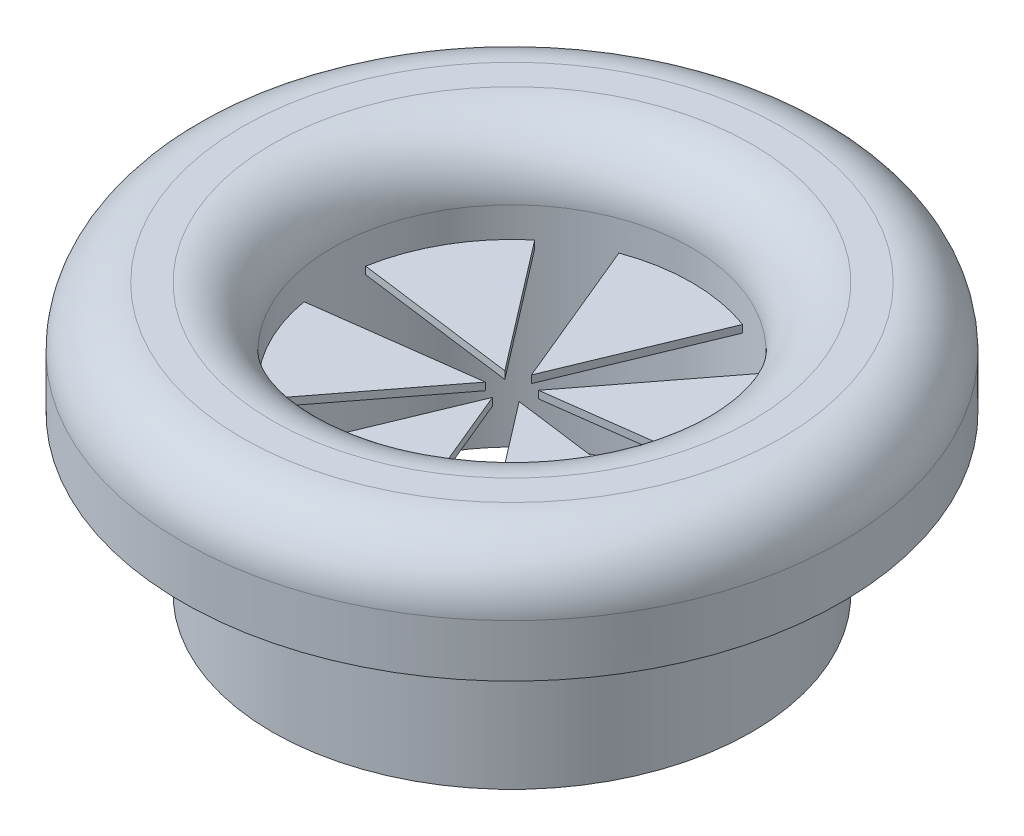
from build123d import *

# Parameters (mm, degrees)
SKETCH1_R           = 8
BOSS_EXTRUDE1_DEPTH = 5
SKETCH2_R           = 11
BOSS_EXTRUDE2_DEPTH = 4
SKETCH3_R           = 6
CUT_EXTRUDE1_DEPTH  = 18.972200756
BOSS_EXTRUDE3_START = -6
BOSS_EXTRUDE3_DEPTH = 0.25
SKETCH5_R           = 11
SKETCH5_R_2         = 10
CUT_EXTRUDE2_DEPTH  = 0.25
FILLET1_R           = 2


with BuildPart() as part:
    # Sketch1 → Boss-Extrude1 (new body)
    with BuildSketch(Plane(origin=(0, 0, 0), x_dir=(1, 0, 0), z_dir=(0, 1, 0))):
        with Locations(Location((0, 0, 0), (0, 0, 270))):
            Circle(SKETCH1_R)
    extrude(amount=BOSS_EXTRUDE1_DEPTH)

    # Sketch2 → Boss-Extrude2 (add)
    with BuildSketch(Plane(origin=(0, 5, 0), x_dir=(1, 0, 0), z_dir=(0, 1, 0))):
        with Locations(Location((0, 0, 0), (0, 0, 270))):
            Circle(SKETCH2_R)
    extrude(amount=BOSS_EXTRUDE2_DEPTH)

    # Sketch3 → Cut-Extrude1 (cut, through all)
    with BuildSketch(Plane(origin=(0, 9, 0), x_dir=(1, 0, 0), z_dir=(0, 1, 0))):
        with Locations(Location((0, 0, 0), (0, 0, 270))):
            Circle(SKETCH3_R)
    extrude(amount=-CUT_EXTRUDE1_DEPTH, mode=Mode.SUBTRACT)

    # Sketch4 → Boss-Extrude3 (add)
    with BuildSketch(Plane.XZ.offset(BOSS_EXTRUDE3_START)):
        with BuildLine():
            Line((0, 0.65), (-2.064316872, 5.633701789))
            ThreePointArc((-2.064316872, 5.633701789), (0, 6), (2.064316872, 5.633701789))
            Line((2.064316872, 5.633701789), (0, 0.65))
        make_face()
        with BuildLine():
            Line((0.562916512, 0.325), (3.846770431, 4.604601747))
            ThreePointArc((3.846770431, 4.604601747), (5.196152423, 3), (5.911087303, 1.029100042))
            Line((5.911087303, 1.029100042), (0.562916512, 0.325))
        make_face()
        with BuildLine():
            Line((0.562916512, -0.325), (5.911087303, -1.029100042))
            ThreePointArc((5.911087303, -1.029100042), (5.196152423, -3), (3.846770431, -4.604601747))
            Line((3.846770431, -4.604601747), (0.562916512, -0.325))
        make_face()
        with BuildLine():
            Line((0, -0.65), (2.064316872, -5.633701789))
            ThreePointArc((2.064316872, -5.633701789), (0, -6), (-2.064316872, -5.633701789))
            Line((-2.064316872, -5.633701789), (0, -0.65))
        make_face()
        with BuildLine():
            Line((-0.562916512, -0.325), (-3.846770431, -4.604601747))
            ThreePointArc((-3.846770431, -4.604601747), (-5.196152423, -3), (-5.911087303, -1.029100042))
            Line((-5.911087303, -1.029100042), (-0.562916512, -0.325))
        make_face()
        with BuildLine():
            Line((-0.562916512, 0.325), (-5.911087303, 1.029100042))
            ThreePointArc((-5.911087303, 1.029100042), (-5.196152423, 3), (-3.846770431, 4.604601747))
            Line((-3.846770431, 4.604601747), (-0.562916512, 0.325))
        make_face()
    extrude(amount=BOSS_EXTRUDE3_DEPTH)

    # Sketch5 → Cut-Extrude2 (cut)
    with BuildSketch(Plane.XZ.offset(-5)):
        with Locations(Location((0, 0, 0), (0, 0, 270))):
            Circle(SKETCH5_R)
        with Locations(Location((0, 0, 0), (0, 0, 270))):
            Circle(SKETCH5_R_2, mode=Mode.SUBTRACT)
    extrude(amount=-CUT_EXTRUDE2_DEPTH, mode=Mode.SUBTRACT)

    # Fillet1
    fillet1_edges = [part.edges().sort_by_distance(p)[0] for p in [
        (0, 9, -6),
        (0, 9, -11),
    ]]
    fillet(fillet1_edges, radius=FILLET1_R)


solid = part.part
